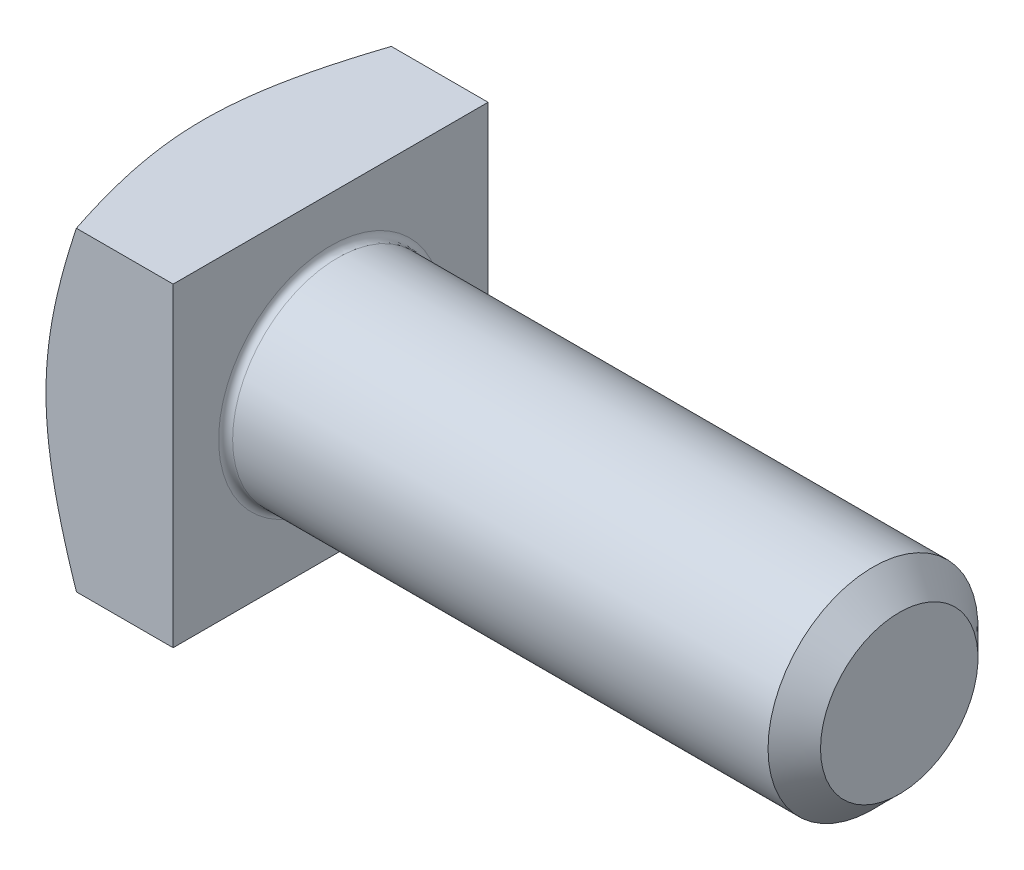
ISO-10303-21;
HEADER;
FILE_DESCRIPTION(('STEP AP214'),'2;1');
FILE_NAME('part.step','',(''),(''),'','','');
FILE_SCHEMA(('AUTOMOTIVE_DESIGN { 1 0 10303 214 1 1 1 1 }'));
ENDSEC;
DATA;
#1=APPLICATION_CONTEXT('core data for automotive mechanical design processes');
#2=APPLICATION_PROTOCOL_DEFINITION('international standard','automotive_design',2000,#1);
#3=PRODUCT_CONTEXT('',#1,'mechanical');
#4=PRODUCT('Part','Part','',(#3));
#5=PRODUCT_RELATED_PRODUCT_CATEGORY('part','',(#4));
#6=PRODUCT_DEFINITION_FORMATION('','',#4);
#7=PRODUCT_DEFINITION_CONTEXT('part definition',#1,'design');
#8=PRODUCT_DEFINITION('design','',#6,#7);
#9=PRODUCT_DEFINITION_SHAPE('','',#8);
#10=(LENGTH_UNIT() NAMED_UNIT(*) SI_UNIT(.MILLI.,.METRE.));
#11=(NAMED_UNIT(*) PLANE_ANGLE_UNIT() SI_UNIT($,.RADIAN.));
#12=(NAMED_UNIT(*) SI_UNIT($,.STERADIAN.) SOLID_ANGLE_UNIT());
#13=UNCERTAINTY_MEASURE_WITH_UNIT(LENGTH_MEASURE(1.E-05),#10,'distance_accuracy_value','');
#14=(GEOMETRIC_REPRESENTATION_CONTEXT(3) GLOBAL_UNCERTAINTY_ASSIGNED_CONTEXT((#13)) GLOBAL_UNIT_ASSIGNED_CONTEXT((#10,
#11,#12)) REPRESENTATION_CONTEXT('',''));
#15=CARTESIAN_POINT('',(0.,0.,0.));
#16=DIRECTION('',(0.,0.,1.));
#17=DIRECTION('',(1.,0.,0.));
#18=AXIS2_PLACEMENT_3D('',#15,#16,#17);
#19=CARTESIAN_POINT('',(15.,-18.,-18.));
#20=DIRECTION('',(0.,0.,1.));
#21=DIRECTION('',(0.,-1.,0.));
#22=AXIS2_PLACEMENT_3D('',#19,#20,#21);
#23=PLANE('',#22);
#24=CARTESIAN_POINT('',(10.9247714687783,-36.2000447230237,-18.));
#25=CARTESIAN_POINT('',(10.7343176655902,-35.7439049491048,-18.));
#26=CARTESIAN_POINT('',(10.5444674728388,-35.2875132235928,-18.));
#27=CARTESIAN_POINT('',(10.1661065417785,-34.3741733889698,-18.));
#28=CARTESIAN_POINT('',(9.9775958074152,-33.9172252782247,-18.));
#29=CARTESIAN_POINT('',(9.41425702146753,-32.5454332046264,-18.));
#30=CARTESIAN_POINT('',(9.04163843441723,-31.6296798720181,-18.));
#31=CARTESIAN_POINT('',(8.30333123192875,-29.7944883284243,-18.));
#32=CARTESIAN_POINT('',(7.93764868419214,-28.8750476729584,-18.));
#33=CARTESIAN_POINT('',(7.21531229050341,-27.0326330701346,-18.));
#34=CARTESIAN_POINT('',(6.85865832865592,-26.1096591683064,-18.));
#35=CARTESIAN_POINT('',(6.15252634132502,-24.2483482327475,-18.));
#36=CARTESIAN_POINT('',(5.80318470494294,-23.309959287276,-18.));
#37=CARTESIAN_POINT('',(5.11938280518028,-21.4277299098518,-18.));
#38=CARTESIAN_POINT('',(4.78492294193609,-20.4838893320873,-18.));
#39=CARTESIAN_POINT('',(4.13521202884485,-18.5893954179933,-18.));
#40=CARTESIAN_POINT('',(3.81996404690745,-17.6387410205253,-18.));
#41=CARTESIAN_POINT('',(3.36605547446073,-16.2067624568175,-18.));
#42=CARTESIAN_POINT('',(3.21791447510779,-15.7284412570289,-18.));
#43=CARTESIAN_POINT('',(2.92890384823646,-14.7696105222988,-18.));
#44=CARTESIAN_POINT('',(2.78803413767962,-14.289101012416,-18.));
#45=CARTESIAN_POINT('',(2.44485283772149,-13.0799346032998,-18.));
#46=CARTESIAN_POINT('',(2.24786291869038,-12.3497525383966,-18.));
#47=CARTESIAN_POINT('',(1.87710985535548,-10.8834675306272,-18.));
#48=CARTESIAN_POINT('',(1.70334669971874,-10.1473645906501,-18.));
#49=CARTESIAN_POINT('',(1.38413226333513,-8.66952650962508,-18.));
#50=CARTESIAN_POINT('',(1.23866132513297,-7.92779565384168,-18.));
#51=CARTESIAN_POINT('',(0.981269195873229,-6.43843147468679,-18.));
#52=CARTESIAN_POINT('',(0.869347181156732,-5.6907982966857,-18.));
#53=CARTESIAN_POINT('',(0.730690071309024,-4.56751568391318,-18.));
#54=CARTESIAN_POINT('',(0.689402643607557,-4.19363031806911,-18.));
#55=CARTESIAN_POINT('',(0.616936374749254,-3.44488705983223,-18.));
#56=CARTESIAN_POINT('',(0.585757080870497,-3.07002921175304,-18.));
#57=CARTESIAN_POINT('',(0.533944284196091,-2.31958068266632,-18.));
#58=CARTESIAN_POINT('',(0.51331087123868,-1.94398999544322,-18.));
#59=CARTESIAN_POINT('',(0.482892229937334,-1.1923829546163,-18.));
#60=CARTESIAN_POINT('',(0.473106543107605,-0.816366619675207,-18.));
#61=CARTESIAN_POINT('',(0.464531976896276,-0.0643838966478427,-18.));
#62=CARTESIAN_POINT('',(0.465737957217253,0.311582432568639,-18.));
#63=CARTESIAN_POINT('',(0.479115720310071,1.06331641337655,-18.));
#64=CARTESIAN_POINT('',(0.491287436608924,1.43908406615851,-18.));
#65=CARTESIAN_POINT('',(0.526414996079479,2.19012091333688,-18.));
#66=CARTESIAN_POINT('',(0.549371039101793,2.56539009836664,-18.));
#67=CARTESIAN_POINT('',(0.605731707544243,3.3151463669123,-18.));
#68=CARTESIAN_POINT('',(0.63913666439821,3.6896334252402,-18.));
#69=CARTESIAN_POINT('',(0.739539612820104,4.66733309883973,-18.));
#70=CARTESIAN_POINT('',(0.814567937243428,5.26973296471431,-18.));
#71=CARTESIAN_POINT('',(0.98826214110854,6.47112337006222,-18.));
#72=CARTESIAN_POINT('',(1.08693033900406,7.07011356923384,-18.));
#73=CARTESIAN_POINT('',(1.30519619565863,8.2645390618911,-18.));
#74=CARTESIAN_POINT('',(1.42480390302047,8.85997250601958,-18.));
#75=CARTESIAN_POINT('',(1.68214141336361,10.04686883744,-18.));
#76=CARTESIAN_POINT('',(1.81987085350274,10.6383318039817,-18.));
#77=CARTESIAN_POINT('',(2.11164542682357,11.820601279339,-18.));
#78=CARTESIAN_POINT('',(2.26577498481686,12.4113868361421,-18.));
#79=CARTESIAN_POINT('',(2.58737312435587,13.589301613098,-18.));
#80=CARTESIAN_POINT('',(2.75484176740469,14.1764308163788,-18.));
#81=CARTESIAN_POINT('',(3.10103850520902,15.3472056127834,-18.));
#82=CARTESIAN_POINT('',(3.27976408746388,15.9308519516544,-18.));
#83=CARTESIAN_POINT('',(3.64677687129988,17.0951193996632,-18.));
#84=CARTESIAN_POINT('',(3.83506404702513,17.675740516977,-18.));
#85=CARTESIAN_POINT('',(4.22773266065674,18.8583337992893,-18.));
#86=CARTESIAN_POINT('',(4.43245774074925,19.4601916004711,-18.));
#87=CARTESIAN_POINT('',(4.84933953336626,20.6613228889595,-18.));
#88=CARTESIAN_POINT('',(5.06149625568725,21.2605963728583,-18.));
#89=CARTESIAN_POINT('',(5.49212916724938,22.4569056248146,-18.));
#90=CARTESIAN_POINT('',(5.71060573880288,23.0539412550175,-18.));
#91=CARTESIAN_POINT('',(6.15293765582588,24.2460173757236,-18.));
#92=CARTESIAN_POINT('',(6.37679302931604,24.8410578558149,-18.));
#93=CARTESIAN_POINT('',(6.82613264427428,26.0215550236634,-18.));
#94=CARTESIAN_POINT('',(7.05155657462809,26.6070346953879,-18.));
#95=CARTESIAN_POINT('',(7.50627943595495,27.7764879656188,-18.));
#96=CARTESIAN_POINT('',(7.73557837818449,28.3604615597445,-18.));
#97=CARTESIAN_POINT('',(8.19747471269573,29.526930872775,-18.));
#98=CARTESIAN_POINT('',(8.43007125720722,30.1094269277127,-18.));
#99=CARTESIAN_POINT('',(8.89819965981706,31.2732298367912,-18.));
#100=CARTESIAN_POINT('',(9.13373147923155,31.8545367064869,-18.));
#101=CARTESIAN_POINT('',(9.3705241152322,32.4353269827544,-18.));
#102=B_SPLINE_CURVE_WITH_KNOTS('',3,(#24,#25,#26,#27,#28,#29,#30,#31,#32,#33,#34,#35,#36,#37,
#38,#39,#40,#41,#42,#43,#44,#45,#46,#47,#48,#49,#50,#51,#52,#53,#54,#55,#56,#57,#58,#59,#60,#61,
#62,#63,#64,#65,#66,#67,#68,#69,#70,#71,#72,#73,#74,#75,#76,#77,#78,#79,#80,#81,#82,#83,#84,#85,
#86,#87,#88,#89,#90,#91,#92,#93,#94,#95,#96,#97,#98,#99,#100,#101),.UNSPECIFIED.,.F.,.F.,(4,2,2,
2,2,2,2,2,2,2,2,2,2,2,2,2,2,2,2,2,2,2,2,2,2,2,2,2,2,2,2,2,2,2,2,2,2,2,4),(0.,1.48291028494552,
2.96582493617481,5.9317790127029,8.90021805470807,11.8686189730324,14.8724365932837,
17.8763349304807,20.8807117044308,22.3828721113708,23.8850153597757,26.153558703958,
28.4221009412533,30.6890613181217,32.9559660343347,34.0843259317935,35.2126352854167,
36.34095425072,37.4692255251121,38.5969691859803,39.7247060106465,40.8524637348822,
41.9802572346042,43.8008578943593,45.6216371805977,47.4432926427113,49.2649116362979,
51.096408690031,52.9279141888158,54.7590123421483,56.5901055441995,58.4972203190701,
60.4043376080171,62.3115705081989,64.2188133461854,66.1009298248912,67.9830517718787,
69.8646983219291,71.746320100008),.UNSPECIFIED.);
#103=CARTESIAN_POINT('',(3.9430248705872,18.,-18.));
#104=VERTEX_POINT('',#103);
#105=CARTESIAN_POINT('',(3.94302487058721,-18.,-18.));
#106=VERTEX_POINT('',#105);
#107=EDGE_CURVE('E65',#104,#106,#102,.F.);
#108=ORIENTED_EDGE('',*,*,#107,.F.);
#109=DIRECTION('',(-1.,0.,0.));
#110=VECTOR('',#109,1.);
#111=CARTESIAN_POINT('',(15.,18.,-18.));
#112=LINE('',#111,#110);
#113=CARTESIAN_POINT('',(15.,18.,-18.));
#114=VERTEX_POINT('',#113);
#115=EDGE_CURVE('E107',#114,#104,#112,.T.);
#116=ORIENTED_EDGE('',*,*,#115,.F.);
#117=DIRECTION('',(0.,1.,0.));
#118=VECTOR('',#117,1.);
#119=CARTESIAN_POINT('',(15.,-18.,-18.));
#120=LINE('',#119,#118);
#121=CARTESIAN_POINT('',(15.,-18.,-18.));
#122=VERTEX_POINT('',#121);
#123=EDGE_CURVE('E196',#122,#114,#120,.T.);
#124=ORIENTED_EDGE('',*,*,#123,.F.);
#125=DIRECTION('',(-1.,0.,0.));
#126=VECTOR('',#125,1.);
#127=CARTESIAN_POINT('',(15.,-18.,-18.));
#128=LINE('',#127,#126);
#129=EDGE_CURVE('E110',#122,#106,#128,.T.);
#130=ORIENTED_EDGE('',*,*,#129,.T.);
#131=EDGE_LOOP('',(#108,#116,#124,#130));
#132=FACE_BOUND('',#131,.T.);
#133=ADVANCED_FACE('F50',(#132),#23,.F.);
#134=CARTESIAN_POINT('',(15.,18.,-18.));
#135=DIRECTION('',(0.,-1.,0.));
#136=DIRECTION('',(0.,0.,-1.));
#137=AXIS2_PLACEMENT_3D('',#134,#135,#136);
#138=PLANE('',#137);
#139=CARTESIAN_POINT('',(10.9247714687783,18.,-36.2000447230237));
#140=CARTESIAN_POINT('',(10.7343176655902,18.,-35.7439049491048));
#141=CARTESIAN_POINT('',(10.5444674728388,18.,-35.2875132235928));
#142=CARTESIAN_POINT('',(10.1661065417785,18.,-34.3741733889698));
#143=CARTESIAN_POINT('',(9.97759580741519,18.,-33.9172252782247));
#144=CARTESIAN_POINT('',(9.41425702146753,18.,-32.5454332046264));
#145=CARTESIAN_POINT('',(9.04163843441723,18.,-31.6296798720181));
#146=CARTESIAN_POINT('',(8.30333123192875,18.,-29.7944883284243));
#147=CARTESIAN_POINT('',(7.93764868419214,18.,-28.8750476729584));
#148=CARTESIAN_POINT('',(7.2153122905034,18.,-27.0326330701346));
#149=CARTESIAN_POINT('',(6.85865832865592,18.,-26.1096591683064));
#150=CARTESIAN_POINT('',(6.15252634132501,18.,-24.2483482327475));
#151=CARTESIAN_POINT('',(5.80318470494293,18.,-23.309959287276));
#152=CARTESIAN_POINT('',(5.11938280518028,18.,-21.4277299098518));
#153=CARTESIAN_POINT('',(4.78492294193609,18.,-20.4838893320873));
#154=CARTESIAN_POINT('',(4.13521202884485,18.,-18.5893954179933));
#155=CARTESIAN_POINT('',(3.81996404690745,18.,-17.6387410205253));
#156=CARTESIAN_POINT('',(3.36605547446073,18.,-16.2067624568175));
#157=CARTESIAN_POINT('',(3.21791447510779,18.,-15.7284412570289));
#158=CARTESIAN_POINT('',(2.92890384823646,18.,-14.7696105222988));
#159=CARTESIAN_POINT('',(2.78803413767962,18.,-14.289101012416));
#160=CARTESIAN_POINT('',(2.44485283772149,18.,-13.0799346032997));
#161=CARTESIAN_POINT('',(2.24786291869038,18.,-12.3497525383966));
#162=CARTESIAN_POINT('',(1.87710985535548,18.,-10.8834675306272));
#163=CARTESIAN_POINT('',(1.70334669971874,18.,-10.1473645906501));
#164=CARTESIAN_POINT('',(1.38413226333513,18.,-8.66952650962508));
#165=CARTESIAN_POINT('',(1.23866132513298,18.,-7.92779565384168));
#166=CARTESIAN_POINT('',(0.981269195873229,18.,-6.43843147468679));
#167=CARTESIAN_POINT('',(0.869347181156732,18.,-5.6907982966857));
#168=CARTESIAN_POINT('',(0.730690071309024,18.,-4.56751568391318));
#169=CARTESIAN_POINT('',(0.689402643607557,18.,-4.19363031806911));
#170=CARTESIAN_POINT('',(0.616936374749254,18.,-3.44488705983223));
#171=CARTESIAN_POINT('',(0.585757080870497,18.,-3.07002921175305));
#172=CARTESIAN_POINT('',(0.533944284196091,18.,-2.31958068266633));
#173=CARTESIAN_POINT('',(0.51331087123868,18.,-1.94398999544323));
#174=CARTESIAN_POINT('',(0.482892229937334,18.,-1.19238295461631));
#175=CARTESIAN_POINT('',(0.473106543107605,18.,-0.816366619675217));
#176=CARTESIAN_POINT('',(0.464531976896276,18.,-0.0643838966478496));
#177=CARTESIAN_POINT('',(0.465737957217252,18.,0.311582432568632));
#178=CARTESIAN_POINT('',(0.479115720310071,18.,1.06331641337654));
#179=CARTESIAN_POINT('',(0.491287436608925,18.,1.4390840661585));
#180=CARTESIAN_POINT('',(0.526414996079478,18.,2.19012091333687));
#181=CARTESIAN_POINT('',(0.549371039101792,18.,2.56539009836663));
#182=CARTESIAN_POINT('',(0.605731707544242,18.,3.31514636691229));
#183=CARTESIAN_POINT('',(0.639136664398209,18.,3.68963342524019));
#184=CARTESIAN_POINT('',(0.739539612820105,18.,4.66733309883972));
#185=CARTESIAN_POINT('',(0.814567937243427,18.,5.26973296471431));
#186=CARTESIAN_POINT('',(0.988262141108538,18.,6.47112337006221));
#187=CARTESIAN_POINT('',(1.08693033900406,18.,7.07011356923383));
#188=CARTESIAN_POINT('',(1.30519619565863,18.,8.26453906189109));
#189=CARTESIAN_POINT('',(1.42480390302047,18.,8.85997250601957));
#190=CARTESIAN_POINT('',(1.68214141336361,18.,10.04686883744));
#191=CARTESIAN_POINT('',(1.81987085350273,18.,10.6383318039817));
#192=CARTESIAN_POINT('',(2.11164542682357,18.,11.820601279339));
#193=CARTESIAN_POINT('',(2.26577498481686,18.,12.4113868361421));
#194=CARTESIAN_POINT('',(2.58737312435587,18.,13.589301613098));
#195=CARTESIAN_POINT('',(2.75484176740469,18.,14.1764308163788));
#196=CARTESIAN_POINT('',(3.10103850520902,18.,15.3472056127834));
#197=CARTESIAN_POINT('',(3.27976408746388,18.,15.9308519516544));
#198=CARTESIAN_POINT('',(3.64677687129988,18.,17.0951193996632));
#199=CARTESIAN_POINT('',(3.83506404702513,18.,17.675740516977));
#200=CARTESIAN_POINT('',(4.22773266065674,18.,18.8583337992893));
#201=CARTESIAN_POINT('',(4.43245774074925,18.,19.4601916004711));
#202=CARTESIAN_POINT('',(4.84933953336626,18.,20.6613228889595));
#203=CARTESIAN_POINT('',(5.06149625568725,18.,21.2605963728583));
#204=CARTESIAN_POINT('',(5.49212916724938,18.,22.4569056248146));
#205=CARTESIAN_POINT('',(5.71060573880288,18.,23.0539412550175));
#206=CARTESIAN_POINT('',(6.15293765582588,18.,24.2460173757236));
#207=CARTESIAN_POINT('',(6.37679302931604,18.,24.8410578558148));
#208=CARTESIAN_POINT('',(6.82613264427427,18.,26.0215550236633));
#209=CARTESIAN_POINT('',(7.05155657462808,18.,26.6070346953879));
#210=CARTESIAN_POINT('',(7.50627943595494,18.,27.7764879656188));
#211=CARTESIAN_POINT('',(7.73557837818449,18.,28.3604615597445));
#212=CARTESIAN_POINT('',(8.19747471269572,18.,29.526930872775));
#213=CARTESIAN_POINT('',(8.43007125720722,18.,30.1094269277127));
#214=CARTESIAN_POINT('',(8.89819965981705,18.,31.2732298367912));
#215=CARTESIAN_POINT('',(9.13373147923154,18.,31.8545367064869));
#216=CARTESIAN_POINT('',(9.3705241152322,18.,32.4353269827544));
#217=B_SPLINE_CURVE_WITH_KNOTS('',3,(#139,#140,#141,#142,#143,#144,#145,#146,#147,#148,#149,
#150,#151,#152,#153,#154,#155,#156,#157,#158,#159,#160,#161,#162,#163,#164,#165,#166,#167,#168,
#169,#170,#171,#172,#173,#174,#175,#176,#177,#178,#179,#180,#181,#182,#183,#184,#185,#186,#187,
#188,#189,#190,#191,#192,#193,#194,#195,#196,#197,#198,#199,#200,#201,#202,#203,#204,#205,#206,
#207,#208,#209,#210,#211,#212,#213,#214,#215,#216),.UNSPECIFIED.,.F.,.F.,(4,2,2,2,2,2,2,2,2,2,2,
2,2,2,2,2,2,2,2,2,2,2,2,2,2,2,2,2,2,2,2,2,2,2,2,2,2,2,4),(0.,1.48291028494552,2.96582493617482,
5.9317790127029,8.90021805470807,11.8686189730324,14.8724365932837,17.8763349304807,
20.8807117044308,22.3828721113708,23.8850153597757,26.153558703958,28.4221009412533,
30.6890613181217,32.9559660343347,34.0843259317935,35.2126352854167,36.34095425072,
37.4692255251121,38.5969691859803,39.7247060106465,40.8524637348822,41.9802572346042,
43.8008578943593,45.6216371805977,47.4432926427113,49.2649116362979,51.096408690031,
52.9279141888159,54.7590123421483,56.5901055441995,58.4972203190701,60.4043376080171,
62.3115705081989,64.2188133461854,66.1009298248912,67.9830517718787,69.8646983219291,
71.746320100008),.UNSPECIFIED.);
#218=CARTESIAN_POINT('',(3.9430248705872,18.,18.));
#219=VERTEX_POINT('',#218);
#220=EDGE_CURVE('E104',#219,#104,#217,.F.);
#221=ORIENTED_EDGE('',*,*,#220,.F.);
#222=DIRECTION('',(-1.,0.,0.));
#223=VECTOR('',#222,1.);
#224=CARTESIAN_POINT('',(15.,18.,18.));
#225=LINE('',#224,#223);
#226=CARTESIAN_POINT('',(15.,18.,18.));
#227=VERTEX_POINT('',#226);
#228=EDGE_CURVE('E101',#227,#219,#225,.T.);
#229=ORIENTED_EDGE('',*,*,#228,.F.);
#230=DIRECTION('',(0.,0.,1.));
#231=VECTOR('',#230,1.);
#232=CARTESIAN_POINT('',(15.,18.,-18.));
#233=LINE('',#232,#231);
#234=EDGE_CURVE('E197',#114,#227,#233,.T.);
#235=ORIENTED_EDGE('',*,*,#234,.F.);
#236=ORIENTED_EDGE('',*,*,#115,.T.);
#237=EDGE_LOOP('',(#221,#229,#235,#236));
#238=FACE_BOUND('',#237,.T.);
#239=ADVANCED_FACE('F131',(#238),#138,.F.);
#240=CARTESIAN_POINT('',(15.,18.,18.));
#241=DIRECTION('',(0.,0.,-1.));
#242=DIRECTION('',(0.,1.,0.));
#243=AXIS2_PLACEMENT_3D('',#240,#241,#242);
#244=PLANE('',#243);
#245=CARTESIAN_POINT('',(10.9247714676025,-36.2000447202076,18.));
#246=CARTESIAN_POINT('',(10.7343176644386,-35.7439049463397,18.));
#247=CARTESIAN_POINT('',(10.5444674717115,-35.2875132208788,18.));
#248=CARTESIAN_POINT('',(10.1661065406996,-34.374173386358,18.));
#249=CARTESIAN_POINT('',(9.97759580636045,-33.9172252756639,18.));
#250=CARTESIAN_POINT('',(9.41425702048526,-32.5454332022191,18.));
#251=CARTESIAN_POINT('',(9.04163843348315,-31.6296798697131,18.));
#252=CARTESIAN_POINT('',(8.30333123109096,-29.794488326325,18.));
#253=CARTESIAN_POINT('',(7.93764868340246,-28.8750476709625,18.));
#254=CARTESIAN_POINT('',(7.21531228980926,-27.0326330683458,18.));
#255=CARTESIAN_POINT('',(6.8586583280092,-26.1096591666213,18.));
#256=CARTESIAN_POINT('',(6.15252634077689,-24.2483482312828,18.));
#257=CARTESIAN_POINT('',(5.80318470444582,-23.309959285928,18.));
#258=CARTESIAN_POINT('',(5.11938280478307,-21.4277299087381,18.));
#259=CARTESIAN_POINT('',(4.78492294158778,-20.4838893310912,18.));
#260=CARTESIAN_POINT('',(4.13521202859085,-18.5893954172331,18.));
#261=CARTESIAN_POINT('',(3.81996404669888,-17.6387410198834,18.));
#262=CARTESIAN_POINT('',(3.36605547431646,-16.2067624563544,18.));
#263=CARTESIAN_POINT('',(3.21791447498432,-15.7284412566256,18.));
#264=CARTESIAN_POINT('',(2.92890384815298,-14.7696105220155,18.));
#265=CARTESIAN_POINT('',(2.78803413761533,-14.2891010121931,18.));
#266=CARTESIAN_POINT('',(2.44485283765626,-13.0799346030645,18.));
#267=CARTESIAN_POINT('',(2.24786291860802,-12.3497525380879,18.));
#268=CARTESIAN_POINT('',(1.87710985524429,-10.8834675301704,18.));
#269=CARTESIAN_POINT('',(1.70334669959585,-10.1473645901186,18.));
#270=CARTESIAN_POINT('',(1.38413226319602,-8.66952650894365,18.));
#271=CARTESIAN_POINT('',(1.23866132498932,-7.92779565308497,18.));
#272=CARTESIAN_POINT('',(0.981269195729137,-6.43843147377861,18.));
#273=CARTESIAN_POINT('',(0.869347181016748,-5.6907982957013,18.));
#274=CARTESIAN_POINT('',(0.730690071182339,-4.56751568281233,18.));
#275=CARTESIAN_POINT('',(0.689402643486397,-4.1936303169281,18.));
#276=CARTESIAN_POINT('',(0.616936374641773,-3.44488705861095,18.));
#277=CARTESIAN_POINT('',(0.58575708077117,-3.07002921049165,18.));
#278=CARTESIAN_POINT('',(0.533944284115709,-2.31958068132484,18.));
#279=CARTESIAN_POINT('',(0.513310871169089,-1.9439899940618,18.));
#280=CARTESIAN_POINT('',(0.482892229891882,-1.19238295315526,18.));
#281=CARTESIAN_POINT('',(0.473106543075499,-0.816366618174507,18.));
#282=CARTESIAN_POINT('',(0.464531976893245,-0.0643838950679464,18.));
#283=CARTESIAN_POINT('',(0.465737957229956,0.311582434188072,18.));
#284=CARTESIAN_POINT('',(0.479115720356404,1.06331641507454,18.));
#285=CARTESIAN_POINT('',(0.491287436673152,1.43908406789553,18.));
#286=CARTESIAN_POINT('',(0.526414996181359,2.19012091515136,18.));
#287=CARTESIAN_POINT('',(0.549371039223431,2.56539010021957,18.));
#288=CARTESIAN_POINT('',(0.605731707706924,3.31514636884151,18.));
#289=CARTESIAN_POINT('',(0.639136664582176,3.68963342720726,18.));
#290=CARTESIAN_POINT('',(0.739539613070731,4.66733310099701,18.));
#291=CARTESIAN_POINT('',(0.814567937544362,5.26973296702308,18.));
#292=CARTESIAN_POINT('',(0.988262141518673,6.47112337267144,18.));
#293=CARTESIAN_POINT('',(1.08693033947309,7.07011357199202,18.));
#294=CARTESIAN_POINT('',(1.30519619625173,8.26453906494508,18.));
#295=CARTESIAN_POINT('',(1.42480390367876,8.85997250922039,18.));
#296=CARTESIAN_POINT('',(1.68214141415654,10.0468688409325,18.));
#297=CARTESIAN_POINT('',(1.8198708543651,10.6383318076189,18.));
#298=CARTESIAN_POINT('',(2.11164542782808,11.8206012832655,18.));
#299=CARTESIAN_POINT('',(2.26577498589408,12.4113868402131,18.));
#300=CARTESIAN_POINT('',(2.58737312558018,13.5893016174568,18.));
#301=CARTESIAN_POINT('',(2.75484176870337,14.1764308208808,18.));
#302=CARTESIAN_POINT('',(3.10103850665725,15.3472056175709,18.));
#303=CARTESIAN_POINT('',(3.27976408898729,15.9308519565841,18.));
#304=CARTESIAN_POINT('',(3.64677687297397,17.0951194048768,18.));
#305=CARTESIAN_POINT('',(3.83506404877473,17.6757405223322,18.));
#306=CARTESIAN_POINT('',(4.22773266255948,18.8583338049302,18.));
#307=CARTESIAN_POINT('',(4.43245774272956,19.460191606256,18.));
#308=CARTESIAN_POINT('',(4.84933953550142,20.6613228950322,18.));
#309=CARTESIAN_POINT('',(5.06149625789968,21.2605963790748,18.));
#310=CARTESIAN_POINT('',(5.49212916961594,22.4569056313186,18.));
#311=CARTESIAN_POINT('',(5.71060574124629,23.0539412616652,18.));
#312=CARTESIAN_POINT('',(6.15293765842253,24.2460173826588,18.));
#313=CARTESIAN_POINT('',(6.37679303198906,24.8410578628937,18.));
#314=CARTESIAN_POINT('',(6.8261326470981,26.0215550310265,18.));
#315=CARTESIAN_POINT('',(7.05155657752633,26.6070347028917,18.));
#316=CARTESIAN_POINT('',(7.50627943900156,27.776487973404,18.));
#317=CARTESIAN_POINT('',(7.73557838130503,28.3604615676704,18.));
#318=CARTESIAN_POINT('',(8.19747471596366,29.5269308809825,18.));
#319=CARTESIAN_POINT('',(8.4300712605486,30.109426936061,18.));
#320=CARTESIAN_POINT('',(8.8981996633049,31.2732298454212,18.));
#321=CARTESIAN_POINT('',(9.13373148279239,31.8545367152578,18.));
#322=CARTESIAN_POINT('',(9.37052411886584,32.4353269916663,18.));
#323=B_SPLINE_CURVE_WITH_KNOTS('',3,(#245,#246,#247,#248,#249,#250,#251,#252,#253,#254,#255,
#256,#257,#258,#259,#260,#261,#262,#263,#264,#265,#266,#267,#268,#269,#270,#271,#272,#273,#274,
#275,#276,#277,#278,#279,#280,#281,#282,#283,#284,#285,#286,#287,#288,#289,#290,#291,#292,#293,
#294,#295,#296,#297,#298,#299,#300,#301,#302,#303,#304,#305,#306,#307,#308,#309,#310,#311,#312,
#313,#314,#315,#316,#317,#318,#319,#320,#321,#322),.UNSPECIFIED.,.F.,.F.,(4,2,2,2,2,2,2,2,2,2,2,
2,2,2,2,2,2,2,2,2,2,2,2,2,2,2,2,2,2,2,2,2,2,2,2,2,2,2,4),(0.,1.48291028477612,2.96582493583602,
5.93177901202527,8.90021805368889,11.8686189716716,14.8724365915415,17.876334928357,
20.8807117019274,22.3828721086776,23.8850153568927,26.153558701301,28.4221009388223,
30.6890613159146,32.9559660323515,34.0843259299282,35.2126352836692,36.3409542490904,
37.4692255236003,38.5969691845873,39.7247060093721,40.8524637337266,41.9802572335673,
43.8008578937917,45.6216371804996,47.4432926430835,49.2649116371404,51.0964086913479,
52.9279141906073,54.7590123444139,56.590105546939,58.4972203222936,60.4043376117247,
62.3115705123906,64.2188133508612,66.1009298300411,67.9830517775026,69.8646983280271,
71.74632010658),.UNSPECIFIED.);
#324=CARTESIAN_POINT('',(3.9430248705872,-18.,18.));
#325=VERTEX_POINT('',#324);
#326=EDGE_CURVE('E87',#325,#219,#323,.T.);
#327=ORIENTED_EDGE('',*,*,#326,.F.);
#328=DIRECTION('',(-1.,0.,0.));
#329=VECTOR('',#328,1.);
#330=CARTESIAN_POINT('',(15.,-18.,18.));
#331=LINE('',#330,#329);
#332=CARTESIAN_POINT('',(15.,-18.,18.));
#333=VERTEX_POINT('',#332);
#334=EDGE_CURVE('E103',#333,#325,#331,.T.);
#335=ORIENTED_EDGE('',*,*,#334,.F.);
#336=DIRECTION('',(0.,-1.,0.));
#337=VECTOR('',#336,1.);
#338=CARTESIAN_POINT('',(15.,18.,18.));
#339=LINE('',#338,#337);
#340=EDGE_CURVE('E202',#227,#333,#339,.T.);
#341=ORIENTED_EDGE('',*,*,#340,.F.);
#342=ORIENTED_EDGE('',*,*,#228,.T.);
#343=EDGE_LOOP('',(#327,#335,#341,#342));
#344=FACE_BOUND('',#343,.T.);
#345=ADVANCED_FACE('F100',(#344),#244,.F.);
#346=CARTESIAN_POINT('',(15.,-18.,18.));
#347=DIRECTION('',(0.,1.,0.));
#348=DIRECTION('',(0.,0.,1.));
#349=AXIS2_PLACEMENT_3D('',#346,#347,#348);
#350=PLANE('',#349);
#351=CARTESIAN_POINT('',(10.9247714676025,-18.,-36.2000447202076));
#352=CARTESIAN_POINT('',(10.7343176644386,-18.,-35.7439049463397));
#353=CARTESIAN_POINT('',(10.5444674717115,-18.,-35.2875132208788));
#354=CARTESIAN_POINT('',(10.1661065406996,-18.,-34.374173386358));
#355=CARTESIAN_POINT('',(9.97759580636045,-18.,-33.9172252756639));
#356=CARTESIAN_POINT('',(9.41425702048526,-18.,-32.5454332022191));
#357=CARTESIAN_POINT('',(9.04163843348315,-18.,-31.6296798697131));
#358=CARTESIAN_POINT('',(8.30333123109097,-18.,-29.794488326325));
#359=CARTESIAN_POINT('',(7.93764868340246,-18.,-28.8750476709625));
#360=CARTESIAN_POINT('',(7.21531228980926,-18.,-27.0326330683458));
#361=CARTESIAN_POINT('',(6.8586583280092,-18.,-26.1096591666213));
#362=CARTESIAN_POINT('',(6.15252634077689,-18.,-24.2483482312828));
#363=CARTESIAN_POINT('',(5.80318470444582,-18.,-23.309959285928));
#364=CARTESIAN_POINT('',(5.11938280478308,-18.,-21.4277299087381));
#365=CARTESIAN_POINT('',(4.78492294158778,-18.,-20.4838893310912));
#366=CARTESIAN_POINT('',(4.13521202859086,-18.,-18.5893954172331));
#367=CARTESIAN_POINT('',(3.81996404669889,-18.,-17.6387410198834));
#368=CARTESIAN_POINT('',(3.36605547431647,-18.,-16.2067624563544));
#369=CARTESIAN_POINT('',(3.21791447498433,-18.,-15.7284412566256));
#370=CARTESIAN_POINT('',(2.92890384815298,-18.,-14.7696105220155));
#371=CARTESIAN_POINT('',(2.78803413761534,-18.,-14.2891010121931));
#372=CARTESIAN_POINT('',(2.44485283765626,-18.,-13.0799346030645));
#373=CARTESIAN_POINT('',(2.24786291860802,-18.,-12.3497525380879));
#374=CARTESIAN_POINT('',(1.87710985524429,-18.,-10.8834675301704));
#375=CARTESIAN_POINT('',(1.70334669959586,-18.,-10.1473645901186));
#376=CARTESIAN_POINT('',(1.38413226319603,-18.,-8.66952650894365));
#377=CARTESIAN_POINT('',(1.23866132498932,-18.,-7.92779565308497));
#378=CARTESIAN_POINT('',(0.98126919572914,-18.,-6.4384314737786));
#379=CARTESIAN_POINT('',(0.86934718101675,-18.,-5.69079829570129));
#380=CARTESIAN_POINT('',(0.730690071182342,-18.,-4.56751568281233));
#381=CARTESIAN_POINT('',(0.6894026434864,-18.,-4.1936303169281));
#382=CARTESIAN_POINT('',(0.616936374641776,-18.,-3.44488705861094));
#383=CARTESIAN_POINT('',(0.585757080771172,-18.,-3.07002921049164));
#384=CARTESIAN_POINT('',(0.533944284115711,-18.,-2.31958068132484));
#385=CARTESIAN_POINT('',(0.513310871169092,-18.,-1.94398999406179));
#386=CARTESIAN_POINT('',(0.482892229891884,-18.,-1.19238295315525));
#387=CARTESIAN_POINT('',(0.473106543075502,-18.,-0.816366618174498));
#388=CARTESIAN_POINT('',(0.464531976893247,-18.,-0.0643838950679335));
#389=CARTESIAN_POINT('',(0.465737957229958,-18.,0.311582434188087));
#390=CARTESIAN_POINT('',(0.479115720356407,-18.,1.06331641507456));
#391=CARTESIAN_POINT('',(0.491287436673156,-18.,1.43908406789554));
#392=CARTESIAN_POINT('',(0.526414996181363,-18.,2.19012091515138));
#393=CARTESIAN_POINT('',(0.549371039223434,-18.,2.56539010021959));
#394=CARTESIAN_POINT('',(0.605731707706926,-18.,3.31514636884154));
#395=CARTESIAN_POINT('',(0.639136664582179,-18.,3.68963342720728));
#396=CARTESIAN_POINT('',(0.739539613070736,-18.,4.66733310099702));
#397=CARTESIAN_POINT('',(0.814567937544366,-18.,5.2697329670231));
#398=CARTESIAN_POINT('',(0.988262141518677,-18.,6.47112337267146));
#399=CARTESIAN_POINT('',(1.08693033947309,-18.,7.07011357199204));
#400=CARTESIAN_POINT('',(1.30519619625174,-18.,8.26453906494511));
#401=CARTESIAN_POINT('',(1.42480390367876,-18.,8.85997250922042));
#402=CARTESIAN_POINT('',(1.68214141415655,-18.,10.0468688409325));
#403=CARTESIAN_POINT('',(1.81987085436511,-18.,10.638331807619));
#404=CARTESIAN_POINT('',(2.11164542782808,-18.,11.8206012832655));
#405=CARTESIAN_POINT('',(2.26577498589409,-18.,12.4113868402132));
#406=CARTESIAN_POINT('',(2.58737312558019,-18.,13.5893016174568));
#407=CARTESIAN_POINT('',(2.75484176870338,-18.,14.1764308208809));
#408=CARTESIAN_POINT('',(3.10103850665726,-18.,15.3472056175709));
#409=CARTESIAN_POINT('',(3.2797640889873,-18.,15.9308519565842));
#410=CARTESIAN_POINT('',(3.64677687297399,-18.,17.0951194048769));
#411=CARTESIAN_POINT('',(3.83506404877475,-18.,17.6757405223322));
#412=CARTESIAN_POINT('',(4.22773266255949,-18.,18.8583338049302));
#413=CARTESIAN_POINT('',(4.43245774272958,-18.,19.4601916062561));
#414=CARTESIAN_POINT('',(4.84933953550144,-18.,20.6613228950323));
#415=CARTESIAN_POINT('',(5.0614962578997,-18.,21.2605963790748));
#416=CARTESIAN_POINT('',(5.49212916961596,-18.,22.4569056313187));
#417=CARTESIAN_POINT('',(5.71060574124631,-18.,23.0539412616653));
#418=CARTESIAN_POINT('',(6.15293765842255,-18.,24.2460173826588));
#419=CARTESIAN_POINT('',(6.37679303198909,-18.,24.8410578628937));
#420=CARTESIAN_POINT('',(6.82613264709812,-18.,26.0215550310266));
#421=CARTESIAN_POINT('',(7.05155657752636,-18.,26.6070347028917));
#422=CARTESIAN_POINT('',(7.50627943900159,-18.,27.776487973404));
#423=CARTESIAN_POINT('',(7.73557838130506,-18.,28.3604615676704));
#424=CARTESIAN_POINT('',(8.19747471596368,-18.,29.5269308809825));
#425=CARTESIAN_POINT('',(8.43007126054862,-18.,30.109426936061));
#426=CARTESIAN_POINT('',(8.89819966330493,-18.,31.2732298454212));
#427=CARTESIAN_POINT('',(9.13373148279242,-18.,31.8545367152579));
#428=CARTESIAN_POINT('',(9.37052411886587,-18.,32.4353269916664));
#429=B_SPLINE_CURVE_WITH_KNOTS('',3,(#351,#352,#353,#354,#355,#356,#357,#358,#359,#360,#361,
#362,#363,#364,#365,#366,#367,#368,#369,#370,#371,#372,#373,#374,#375,#376,#377,#378,#379,#380,
#381,#382,#383,#384,#385,#386,#387,#388,#389,#390,#391,#392,#393,#394,#395,#396,#397,#398,#399,
#400,#401,#402,#403,#404,#405,#406,#407,#408,#409,#410,#411,#412,#413,#414,#415,#416,#417,#418,
#419,#420,#421,#422,#423,#424,#425,#426,#427,#428),.UNSPECIFIED.,.F.,.F.,(4,2,2,2,2,2,2,2,2,2,2,
2,2,2,2,2,2,2,2,2,2,2,2,2,2,2,2,2,2,2,2,2,2,2,2,2,2,2,4),(0.,1.48291028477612,2.96582493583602,
5.93177901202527,8.90021805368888,11.8686189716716,14.8724365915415,17.876334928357,
20.8807117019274,22.3828721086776,23.8850153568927,26.153558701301,28.4221009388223,
30.6890613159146,32.9559660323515,34.0843259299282,35.2126352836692,36.3409542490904,
37.4692255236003,38.5969691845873,39.7247060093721,40.8524637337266,41.9802572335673,
43.8008578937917,45.6216371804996,47.4432926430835,49.2649116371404,51.096408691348,
52.9279141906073,54.7590123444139,56.5901055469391,58.4972203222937,60.4043376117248,
62.3115705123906,64.2188133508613,66.1009298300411,67.9830517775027,69.8646983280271,
71.7463201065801),.UNSPECIFIED.);
#430=EDGE_CURVE('E86',#106,#325,#429,.T.);
#431=ORIENTED_EDGE('',*,*,#430,.F.);
#432=ORIENTED_EDGE('',*,*,#129,.F.);
#433=DIRECTION('',(0.,0.,-1.));
#434=VECTOR('',#433,1.);
#435=CARTESIAN_POINT('',(15.,-18.,18.));
#436=LINE('',#435,#434);
#437=EDGE_CURVE('E69',#333,#122,#436,.T.);
#438=ORIENTED_EDGE('',*,*,#437,.F.);
#439=ORIENTED_EDGE('',*,*,#334,.T.);
#440=EDGE_LOOP('',(#431,#432,#438,#439));
#441=FACE_BOUND('',#440,.T.);
#442=ADVANCED_FACE('F106',(#441),#350,.F.);
#443=CARTESIAN_POINT('',(15.,18.,-18.));
#444=DIRECTION('',(1.,0.,0.));
#445=DIRECTION('',(0.,0.,-1.));
#446=AXIS2_PLACEMENT_3D('',#443,#444,#445);
#447=PLANE('',#446);
#448=CARTESIAN_POINT('',(15.,0.,0.));
#449=DIRECTION('',(1.,0.,0.));
#450=DIRECTION('',(0.,0.,-1.));
#451=AXIS2_PLACEMENT_3D('',#448,#449,#450);
#452=CIRCLE('',#451,12.8);
#453=CARTESIAN_POINT('',(15.,0.,-12.8));
#454=VERTEX_POINT('',#453);
#455=EDGE_CURVE('E54',#454,#454,#452,.F.);
#456=ORIENTED_EDGE('',*,*,#455,.T.);
#457=EDGE_LOOP('',(#456));
#458=FACE_BOUND('',#457,.T.);
#459=ORIENTED_EDGE('',*,*,#123,.T.);
#460=ORIENTED_EDGE('',*,*,#234,.T.);
#461=ORIENTED_EDGE('',*,*,#340,.T.);
#462=ORIENTED_EDGE('',*,*,#437,.T.);
#463=EDGE_LOOP('',(#459,#460,#461,#462));
#464=FACE_BOUND('',#463,.T.);
#465=ADVANCED_FACE('F117',(#458,#464),#447,.T.);
#466=CARTESIAN_POINT('',(0.,0.,0.));
#467=DIRECTION('',(-1.,0.,0.));
#468=DIRECTION('',(0.,0.,1.));
#469=AXIS2_PLACEMENT_3D('',#466,#467,#468);
#470=CYLINDRICAL_SURFACE('',#469,12.);
#471=CARTESIAN_POINT('',(15.8,0.,0.));
#472=DIRECTION('',(1.,0.,0.));
#473=DIRECTION('',(0.,0.,-1.));
#474=AXIS2_PLACEMENT_3D('',#471,#472,#473);
#475=CIRCLE('',#474,12.);
#476=CARTESIAN_POINT('',(15.8,0.,-12.));
#477=VERTEX_POINT('',#476);
#478=EDGE_CURVE('E12',#477,#477,#475,.T.);
#479=ORIENTED_EDGE('',*,*,#478,.T.);
#480=EDGE_LOOP('',(#479));
#481=FACE_BOUND('',#480,.T.);
#482=CARTESIAN_POINT('',(77.,0.,0.));
#483=DIRECTION('',(-1.,0.,0.));
#484=DIRECTION('',(0.,0.,1.));
#485=AXIS2_PLACEMENT_3D('',#482,#483,#484);
#486=CIRCLE('',#485,12.);
#487=CARTESIAN_POINT('',(77.,0.,12.));
#488=VERTEX_POINT('',#487);
#489=EDGE_CURVE('E149',#488,#488,#486,.T.);
#490=ORIENTED_EDGE('',*,*,#489,.T.);
#491=EDGE_LOOP('',(#490));
#492=FACE_BOUND('',#491,.T.);
#493=ADVANCED_FACE('F182',(#481,#492),#470,.T.);
#494=CARTESIAN_POINT('',(80.,0.,0.));
#495=DIRECTION('',(-1.,0.,0.));
#496=DIRECTION('',(0.,0.,1.));
#497=AXIS2_PLACEMENT_3D('',#494,#495,#496);
#498=CONICAL_SURFACE('',#497,8.99999999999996,0.785398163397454);
#499=ORIENTED_EDGE('',*,*,#489,.F.);
#500=EDGE_LOOP('',(#499));
#501=FACE_BOUND('',#500,.T.);
#502=CARTESIAN_POINT('',(80.,0.,0.));
#503=DIRECTION('',(-1.,0.,0.));
#504=DIRECTION('',(0.,0.,1.));
#505=AXIS2_PLACEMENT_3D('',#502,#503,#504);
#506=CIRCLE('',#505,8.99999999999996);
#507=CARTESIAN_POINT('',(80.,0.,8.99999999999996));
#508=VERTEX_POINT('',#507);
#509=EDGE_CURVE('E192',#508,#508,#506,.T.);
#510=ORIENTED_EDGE('',*,*,#509,.T.);
#511=EDGE_LOOP('',(#510));
#512=FACE_BOUND('',#511,.T.);
#513=ADVANCED_FACE('F163',(#501,#512),#498,.T.);
#514=CARTESIAN_POINT('',(80.,0.,0.));
#515=DIRECTION('',(-1.,0.,0.));
#516=DIRECTION('',(0.,0.,1.));
#517=AXIS2_PLACEMENT_3D('',#514,#515,#516);
#518=PLANE('',#517);
#519=ORIENTED_EDGE('',*,*,#509,.F.);
#520=EDGE_LOOP('',(#519));
#521=FACE_BOUND('',#520,.T.);
#522=ADVANCED_FACE('F160',(#521),#518,.F.);
#523=CARTESIAN_POINT('',(0.,0.,0.));
#524=DIRECTION('',(1.,0.,0.));
#525=DIRECTION('',(0.,0.,-1.));
#526=AXIS2_PLACEMENT_3D('',#523,#524,#525);
#527=CONICAL_SURFACE('',#526,17.,1.13446401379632);
#528=CARTESIAN_POINT('',(0.,0.,0.));
#529=DIRECTION('',(-1.,0.,0.));
#530=DIRECTION('',(0.,0.,1.));
#531=AXIS2_PLACEMENT_3D('',#528,#529,#530);
#532=CIRCLE('',#531,17.);
#533=CARTESIAN_POINT('',(0.,0.,17.));
#534=VERTEX_POINT('',#533);
#535=EDGE_CURVE('E95',#534,#534,#532,.T.);
#536=ORIENTED_EDGE('',*,*,#535,.F.);
#537=EDGE_LOOP('',(#536));
#538=FACE_BOUND('',#537,.T.);
#539=ORIENTED_EDGE('',*,*,#107,.T.);
#540=ORIENTED_EDGE('',*,*,#430,.T.);
#541=ORIENTED_EDGE('',*,*,#326,.T.);
#542=ORIENTED_EDGE('',*,*,#220,.T.);
#543=EDGE_LOOP('',(#539,#540,#541,#542));
#544=FACE_BOUND('',#543,.T.);
#545=ADVANCED_FACE('F88',(#538,#544),#527,.T.);
#546=CARTESIAN_POINT('',(0.,18.,-18.));
#547=DIRECTION('',(1.,0.,0.));
#548=DIRECTION('',(0.,0.,-1.));
#549=AXIS2_PLACEMENT_3D('',#546,#547,#548);
#550=PLANE('',#549);
#551=ORIENTED_EDGE('',*,*,#535,.T.);
#552=EDGE_LOOP('',(#551));
#553=FACE_BOUND('',#552,.T.);
#554=ADVANCED_FACE('F122',(#553),#550,.F.);
#555=CARTESIAN_POINT('',(15.8,0.,0.));
#556=DIRECTION('',(1.,0.,0.));
#557=DIRECTION('',(0.,0.,-1.));
#558=AXIS2_PLACEMENT_3D('',#555,#556,#557);
#559=TOROIDAL_SURFACE('',#558,12.8,0.8);
#560=ORIENTED_EDGE('',*,*,#478,.F.);
#561=EDGE_LOOP('',(#560));
#562=FACE_BOUND('',#561,.T.);
#563=ORIENTED_EDGE('',*,*,#455,.F.);
#564=EDGE_LOOP('',(#563));
#565=FACE_BOUND('',#564,.T.);
#566=ADVANCED_FACE('F47',(#562,#565),#559,.F.);
#567=CLOSED_SHELL('',(#133,#239,#345,#442,#465,#493,#513,#522,#545,#554,#566));
#568=MANIFOLD_SOLID_BREP('B2',#567);
#569=ADVANCED_BREP_SHAPE_REPRESENTATION('',(#18,#568),#14);
#570=SHAPE_DEFINITION_REPRESENTATION(#9,#569);
ENDSEC;
END-ISO-10303-21;
